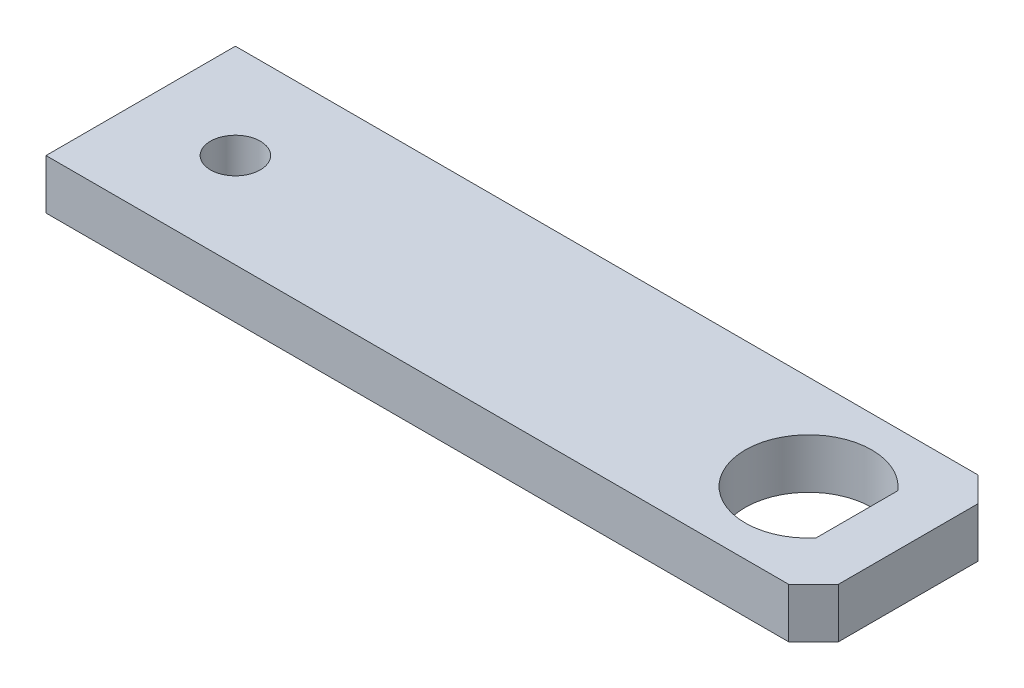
from build123d import *

# Parameters (mm, degrees)
SKIZZE1_R               = 2.5
LINEAR_AUSTRAGEN1_DEPTH = 5


with BuildPart() as part:
    # Skizze1 → Linear austragen1 (new body)
    with BuildSketch(Plane.XZ):
        Polygon((77, 2.5), (77, 16.5), (74.5, 19), (0, 19), (0, 0), (74.5, 0), align=None)
        with Locations(Location((9.5, 9.5, 0), (0, 0, 90))):
            Circle(SKIZZE1_R, mode=Mode.SUBTRACT)
        with BuildLine():
            Line((71.85, 13.598780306), (71.85, 5.401219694))
            ThreePointArc((71.85, 5.401219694), (60.65, 9.5), (71.85, 13.598780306))
        make_face(mode=Mode.SUBTRACT)
    extrude(amount=-LINEAR_AUSTRAGEN1_DEPTH)


solid = part.part
